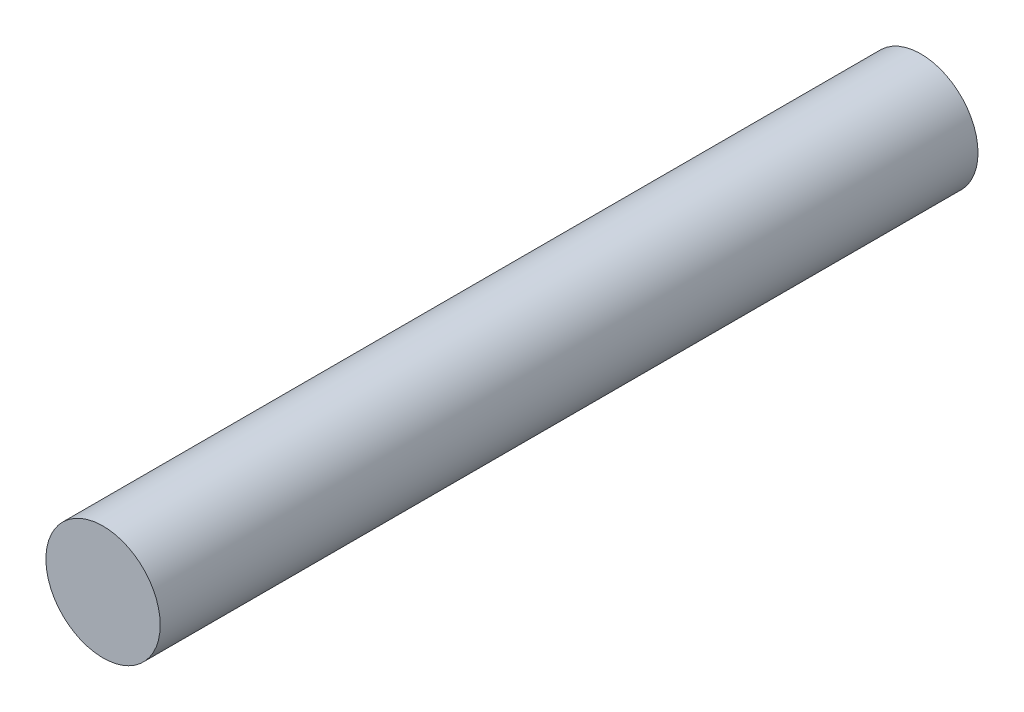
ISO-10303-21;
HEADER;
FILE_DESCRIPTION(('STEP AP214'),'2;1');
FILE_NAME('part.step','',(''),(''),'','','');
FILE_SCHEMA(('AUTOMOTIVE_DESIGN { 1 0 10303 214 1 1 1 1 }'));
ENDSEC;
DATA;
#1=APPLICATION_CONTEXT('core data for automotive mechanical design processes');
#2=APPLICATION_PROTOCOL_DEFINITION('international standard','automotive_design',2000,#1);
#3=PRODUCT_CONTEXT('',#1,'mechanical');
#4=PRODUCT('Part','Part','',(#3));
#5=PRODUCT_RELATED_PRODUCT_CATEGORY('part','',(#4));
#6=PRODUCT_DEFINITION_FORMATION('','',#4);
#7=PRODUCT_DEFINITION_CONTEXT('part definition',#1,'design');
#8=PRODUCT_DEFINITION('design','',#6,#7);
#9=PRODUCT_DEFINITION_SHAPE('','',#8);
#10=(LENGTH_UNIT() NAMED_UNIT(*) SI_UNIT(.MILLI.,.METRE.));
#11=(NAMED_UNIT(*) PLANE_ANGLE_UNIT() SI_UNIT($,.RADIAN.));
#12=(NAMED_UNIT(*) SI_UNIT($,.STERADIAN.) SOLID_ANGLE_UNIT());
#13=UNCERTAINTY_MEASURE_WITH_UNIT(LENGTH_MEASURE(1.E-05),#10,'distance_accuracy_value','');
#14=(GEOMETRIC_REPRESENTATION_CONTEXT(3) GLOBAL_UNCERTAINTY_ASSIGNED_CONTEXT((#13)) GLOBAL_UNIT_ASSIGNED_CONTEXT((#10,
#11,#12)) REPRESENTATION_CONTEXT('',''));
#15=CARTESIAN_POINT('',(0.,0.,0.));
#16=DIRECTION('',(0.,0.,1.));
#17=DIRECTION('',(1.,0.,0.));
#18=AXIS2_PLACEMENT_3D('',#15,#16,#17);
#19=CARTESIAN_POINT('',(0.,0.,-71.5470053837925));
#20=DIRECTION('',(0.,0.,1.));
#21=DIRECTION('',(1.,0.,0.));
#22=AXIS2_PLACEMENT_3D('',#19,#20,#21);
#23=CYLINDRICAL_SURFACE('',#22,5.);
#24=CARTESIAN_POINT('',(0.,0.,-71.5470053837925));
#25=DIRECTION('',(0.,0.,1.));
#26=DIRECTION('',(1.,0.,0.));
#27=AXIS2_PLACEMENT_3D('',#24,#25,#26);
#28=CIRCLE('',#27,5.);
#29=CARTESIAN_POINT('',(5.,0.,-71.5470053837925));
#30=VERTEX_POINT('',#29);
#31=EDGE_CURVE('E10',#30,#30,#28,.T.);
#32=ORIENTED_EDGE('',*,*,#31,.T.);
#33=EDGE_LOOP('',(#32));
#34=FACE_BOUND('',#33,.T.);
#35=CARTESIAN_POINT('',(0.,0.,0.));
#36=DIRECTION('',(0.,0.,1.));
#37=DIRECTION('',(1.,0.,0.));
#38=AXIS2_PLACEMENT_3D('',#35,#36,#37);
#39=CIRCLE('',#38,5.);
#40=CARTESIAN_POINT('',(5.,0.,0.));
#41=VERTEX_POINT('',#40);
#42=EDGE_CURVE('E37',#41,#41,#39,.T.);
#43=ORIENTED_EDGE('',*,*,#42,.F.);
#44=EDGE_LOOP('',(#43));
#45=FACE_BOUND('',#44,.T.);
#46=ADVANCED_FACE('F34',(#34,#45),#23,.T.);
#47=CARTESIAN_POINT('',(0.,0.,-71.5470053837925));
#48=DIRECTION('',(0.,0.,1.));
#49=DIRECTION('',(1.,0.,0.));
#50=AXIS2_PLACEMENT_3D('',#47,#48,#49);
#51=PLANE('',#50);
#52=ORIENTED_EDGE('',*,*,#31,.F.);
#53=EDGE_LOOP('',(#52));
#54=FACE_BOUND('',#53,.T.);
#55=ADVANCED_FACE('F49',(#54),#51,.F.);
#56=CARTESIAN_POINT('',(0.,0.,0.));
#57=DIRECTION('',(0.,0.,1.));
#58=DIRECTION('',(1.,0.,0.));
#59=AXIS2_PLACEMENT_3D('',#56,#57,#58);
#60=PLANE('',#59);
#61=ORIENTED_EDGE('',*,*,#42,.T.);
#62=EDGE_LOOP('',(#61));
#63=FACE_BOUND('',#62,.T.);
#64=ADVANCED_FACE('F46',(#63),#60,.T.);
#65=CLOSED_SHELL('',(#46,#55,#64));
#66=MANIFOLD_SOLID_BREP('B2',#65);
#67=ADVANCED_BREP_SHAPE_REPRESENTATION('',(#18,#66),#14);
#68=SHAPE_DEFINITION_REPRESENTATION(#9,#67);
ENDSEC;
END-ISO-10303-21;
